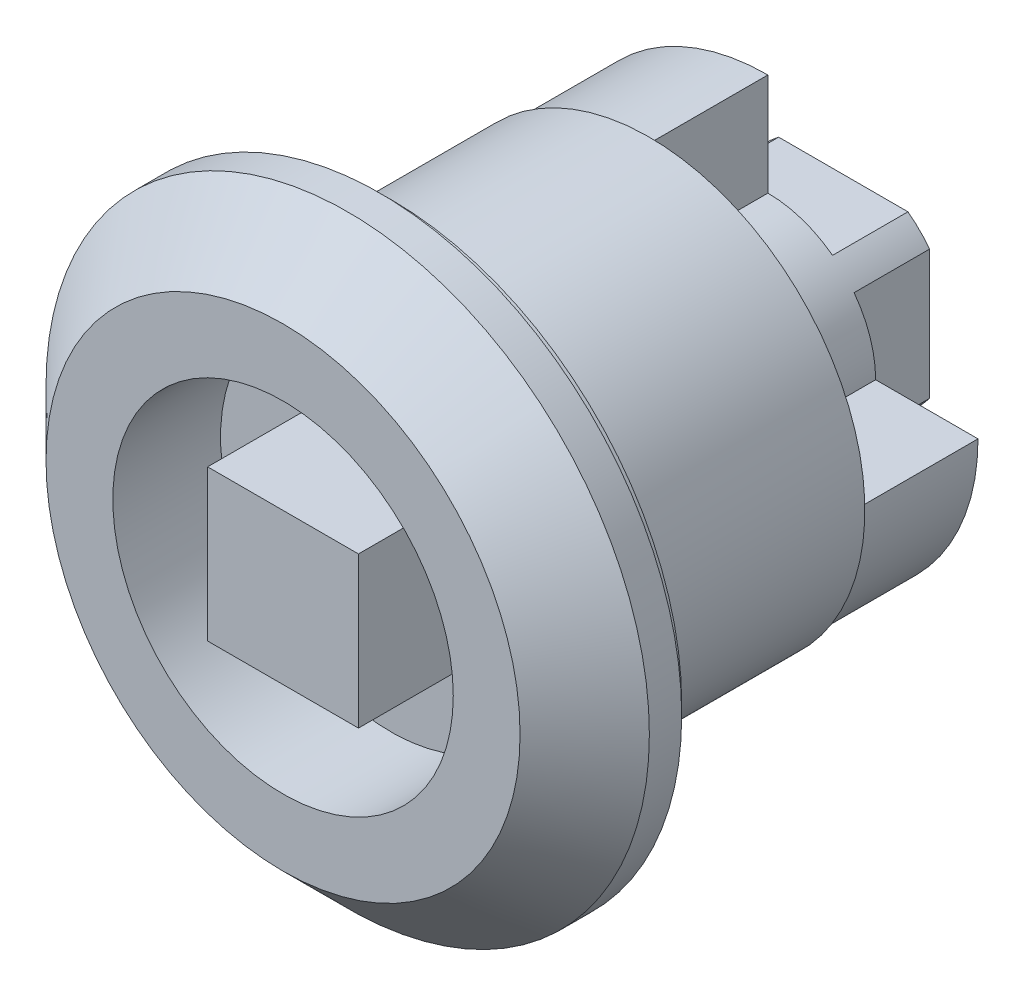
ISO-10303-21;
HEADER;
FILE_DESCRIPTION(('STEP AP214'),'2;1');
FILE_NAME('part.step','',(''),(''),'','','');
FILE_SCHEMA(('AUTOMOTIVE_DESIGN { 1 0 10303 214 1 1 1 1 }'));
ENDSEC;
DATA;
#1=APPLICATION_CONTEXT('core data for automotive mechanical design processes');
#2=APPLICATION_PROTOCOL_DEFINITION('international standard','automotive_design',2000,#1);
#3=PRODUCT_CONTEXT('',#1,'mechanical');
#4=PRODUCT('Part','Part','',(#3));
#5=PRODUCT_RELATED_PRODUCT_CATEGORY('part','',(#4));
#6=PRODUCT_DEFINITION_FORMATION('','',#4);
#7=PRODUCT_DEFINITION_CONTEXT('part definition',#1,'design');
#8=PRODUCT_DEFINITION('design','',#6,#7);
#9=PRODUCT_DEFINITION_SHAPE('','',#8);
#10=(LENGTH_UNIT() NAMED_UNIT(*) SI_UNIT(.MILLI.,.METRE.));
#11=(NAMED_UNIT(*) PLANE_ANGLE_UNIT() SI_UNIT($,.RADIAN.));
#12=(NAMED_UNIT(*) SI_UNIT($,.STERADIAN.) SOLID_ANGLE_UNIT());
#13=UNCERTAINTY_MEASURE_WITH_UNIT(LENGTH_MEASURE(1.E-05),#10,'distance_accuracy_value','');
#14=(GEOMETRIC_REPRESENTATION_CONTEXT(3) GLOBAL_UNCERTAINTY_ASSIGNED_CONTEXT((#13)) GLOBAL_UNIT_ASSIGNED_CONTEXT((#10,
#11,#12)) REPRESENTATION_CONTEXT('',''));
#15=CARTESIAN_POINT('',(0.,0.,0.));
#16=DIRECTION('',(0.,0.,1.));
#17=DIRECTION('',(1.,0.,0.));
#18=AXIS2_PLACEMENT_3D('',#15,#16,#17);
#19=CARTESIAN_POINT('',(0.,0.,-50.));
#20=DIRECTION('',(0.,0.,-1.));
#21=DIRECTION('',(-1.,0.,0.));
#22=AXIS2_PLACEMENT_3D('',#19,#20,#21);
#23=CYLINDRICAL_SURFACE('',#22,5.);
#24=CARTESIAN_POINT('',(0.,0.,-17.5));
#25=DIRECTION('',(0.,0.,-1.));
#26=DIRECTION('',(-1.,0.,0.));
#27=AXIS2_PLACEMENT_3D('',#24,#25,#26);
#28=CIRCLE('',#27,5.);
#29=CARTESIAN_POINT('',(-4.,3.,-17.5));
#30=VERTEX_POINT('',#29);
#31=CARTESIAN_POINT('',(-3.,4.,-17.5));
#32=VERTEX_POINT('',#31);
#33=EDGE_CURVE('E262',#30,#32,#28,.T.);
#34=ORIENTED_EDGE('',*,*,#33,.T.);
#35=DIRECTION('',(0.,0.,-1.));
#36=VECTOR('',#35,1.);
#37=CARTESIAN_POINT('',(-3.,4.,-11.4172374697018));
#38=LINE('',#37,#36);
#39=CARTESIAN_POINT('',(-3.,4.,-21.));
#40=VERTEX_POINT('',#39);
#41=EDGE_CURVE('E204',#32,#40,#38,.T.);
#42=ORIENTED_EDGE('',*,*,#41,.T.);
#43=CARTESIAN_POINT('',(0.,0.,-21.));
#44=DIRECTION('',(0.,0.,-1.));
#45=DIRECTION('',(-1.,0.,0.));
#46=AXIS2_PLACEMENT_3D('',#43,#44,#45);
#47=CIRCLE('',#46,5.);
#48=CARTESIAN_POINT('',(-4.,3.,-21.));
#49=VERTEX_POINT('',#48);
#50=EDGE_CURVE('E264',#49,#40,#47,.T.);
#51=ORIENTED_EDGE('',*,*,#50,.F.);
#52=DIRECTION('',(0.,0.,-1.));
#53=VECTOR('',#52,1.);
#54=CARTESIAN_POINT('',(-4.,3.,-11.4172374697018));
#55=LINE('',#54,#53);
#56=EDGE_CURVE('E228',#30,#49,#55,.T.);
#57=ORIENTED_EDGE('',*,*,#56,.F.);
#58=EDGE_LOOP('',(#34,#42,#51,#57));
#59=FACE_BOUND('',#58,.T.);
#60=ADVANCED_FACE('F14',(#59),#23,.T.);
#61=DIRECTION('',(0.,0.,-1.));
#62=VECTOR('',#61,1.);
#63=CARTESIAN_POINT('',(-3.,-4.,-11.4172374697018));
#64=LINE('',#63,#62);
#65=CARTESIAN_POINT('',(-3.,-4.,-17.5));
#66=VERTEX_POINT('',#65);
#67=CARTESIAN_POINT('',(-3.,-4.,-21.));
#68=VERTEX_POINT('',#67);
#69=EDGE_CURVE('E209',#66,#68,#64,.T.);
#70=ORIENTED_EDGE('',*,*,#69,.F.);
#71=CARTESIAN_POINT('',(-4.,-3.,-17.5));
#72=VERTEX_POINT('',#71);
#73=EDGE_CURVE('E269',#66,#72,#28,.T.);
#74=ORIENTED_EDGE('',*,*,#73,.T.);
#75=DIRECTION('',(0.,0.,-1.));
#76=VECTOR('',#75,1.);
#77=CARTESIAN_POINT('',(-4.,-3.,-11.4172374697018));
#78=LINE('',#77,#76);
#79=CARTESIAN_POINT('',(-4.,-3.,-21.));
#80=VERTEX_POINT('',#79);
#81=EDGE_CURVE('E225',#72,#80,#78,.T.);
#82=ORIENTED_EDGE('',*,*,#81,.T.);
#83=EDGE_CURVE('E263',#68,#80,#47,.T.);
#84=ORIENTED_EDGE('',*,*,#83,.F.);
#85=EDGE_LOOP('',(#70,#74,#82,#84));
#86=FACE_BOUND('',#85,.T.);
#87=ADVANCED_FACE('F316',(#86),#23,.T.);
#88=DIRECTION('',(0.,0.,-1.));
#89=VECTOR('',#88,1.);
#90=CARTESIAN_POINT('',(3.,-4.,-11.4172374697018));
#91=LINE('',#90,#89);
#92=CARTESIAN_POINT('',(3.,-4.,-17.5));
#93=VERTEX_POINT('',#92);
#94=CARTESIAN_POINT('',(3.,-4.,-21.));
#95=VERTEX_POINT('',#94);
#96=EDGE_CURVE('E214',#93,#95,#91,.T.);
#97=ORIENTED_EDGE('',*,*,#96,.T.);
#98=CARTESIAN_POINT('',(4.,-3.,-21.));
#99=VERTEX_POINT('',#98);
#100=EDGE_CURVE('E259',#99,#95,#47,.T.);
#101=ORIENTED_EDGE('',*,*,#100,.F.);
#102=DIRECTION('',(0.,0.,-1.));
#103=VECTOR('',#102,1.);
#104=CARTESIAN_POINT('',(4.,-3.,-11.4172374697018));
#105=LINE('',#104,#103);
#106=CARTESIAN_POINT('',(4.,-3.,-17.5));
#107=VERTEX_POINT('',#106);
#108=EDGE_CURVE('E230',#107,#99,#105,.T.);
#109=ORIENTED_EDGE('',*,*,#108,.F.);
#110=EDGE_CURVE('E265',#107,#93,#28,.T.);
#111=ORIENTED_EDGE('',*,*,#110,.T.);
#112=EDGE_LOOP('',(#97,#101,#109,#111));
#113=FACE_BOUND('',#112,.T.);
#114=ADVANCED_FACE('F327',(#113),#23,.T.);
#115=CARTESIAN_POINT('',(0.,5.,-21.));
#116=DIRECTION('',(0.,0.,1.));
#117=DIRECTION('',(1.,0.,0.));
#118=AXIS2_PLACEMENT_3D('',#115,#116,#117);
#119=PLANE('',#118);
#120=CARTESIAN_POINT('',(0.,0.,-21.));
#121=DIRECTION('',(0.,0.,-1.));
#122=DIRECTION('',(-1.,0.,0.));
#123=AXIS2_PLACEMENT_3D('',#120,#121,#122);
#124=CIRCLE('',#123,3.);
#125=CARTESIAN_POINT('',(-3.,0.,-21.));
#126=VERTEX_POINT('',#125);
#127=EDGE_CURVE('E172',#126,#126,#124,.T.);
#128=ORIENTED_EDGE('',*,*,#127,.F.);
#129=EDGE_LOOP('',(#128));
#130=FACE_BOUND('',#129,.T.);
#131=ORIENTED_EDGE('',*,*,#50,.T.);
#132=DIRECTION('',(-1.,0.,0.));
#133=VECTOR('',#132,1.);
#134=CARTESIAN_POINT('',(3.,4.,-21.));
#135=LINE('',#134,#133);
#136=CARTESIAN_POINT('',(3.,4.,-21.));
#137=VERTEX_POINT('',#136);
#138=EDGE_CURVE('E194',#137,#40,#135,.T.);
#139=ORIENTED_EDGE('',*,*,#138,.F.);
#140=CARTESIAN_POINT('',(4.,3.,-21.));
#141=VERTEX_POINT('',#140);
#142=EDGE_CURVE('E258',#137,#141,#47,.T.);
#143=ORIENTED_EDGE('',*,*,#142,.T.);
#144=DIRECTION('',(0.,-1.,0.));
#145=VECTOR('',#144,1.);
#146=CARTESIAN_POINT('',(4.,3.,-21.));
#147=LINE('',#146,#145);
#148=EDGE_CURVE('E231',#141,#99,#147,.T.);
#149=ORIENTED_EDGE('',*,*,#148,.T.);
#150=ORIENTED_EDGE('',*,*,#100,.T.);
#151=DIRECTION('',(-1.,0.,0.));
#152=VECTOR('',#151,1.);
#153=CARTESIAN_POINT('',(3.,-4.,-21.));
#154=LINE('',#153,#152);
#155=EDGE_CURVE('E210',#95,#68,#154,.T.);
#156=ORIENTED_EDGE('',*,*,#155,.T.);
#157=ORIENTED_EDGE('',*,*,#83,.T.);
#158=DIRECTION('',(0.,-1.,0.));
#159=VECTOR('',#158,1.);
#160=CARTESIAN_POINT('',(-4.,3.,-21.));
#161=LINE('',#160,#159);
#162=EDGE_CURVE('E216',#49,#80,#161,.T.);
#163=ORIENTED_EDGE('',*,*,#162,.F.);
#164=EDGE_LOOP('',(#131,#139,#143,#149,#150,#156,#157,#163));
#165=FACE_BOUND('',#164,.T.);
#166=ADVANCED_FACE('F304',(#130,#165),#119,.F.);
#167=ORIENTED_EDGE('',*,*,#142,.F.);
#168=DIRECTION('',(0.,0.,-1.));
#169=VECTOR('',#168,1.);
#170=CARTESIAN_POINT('',(3.,4.,-11.4172374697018));
#171=LINE('',#170,#169);
#172=CARTESIAN_POINT('',(3.,4.,-17.5));
#173=VERTEX_POINT('',#172);
#174=EDGE_CURVE('E207',#173,#137,#171,.T.);
#175=ORIENTED_EDGE('',*,*,#174,.F.);
#176=CARTESIAN_POINT('',(0.,0.,-17.5));
#177=DIRECTION('',(0.,0.,-1.));
#178=DIRECTION('',(-1.,0.,0.));
#179=AXIS2_PLACEMENT_3D('',#176,#177,#178);
#180=CIRCLE('',#179,5.);
#181=CARTESIAN_POINT('',(0.,5.,-17.5));
#182=VERTEX_POINT('',#181);
#183=EDGE_CURVE('E182',#182,#173,#180,.T.);
#184=ORIENTED_EDGE('',*,*,#183,.F.);
#185=DIRECTION('',(0.,0.,-1.));
#186=VECTOR('',#185,1.);
#187=CARTESIAN_POINT('',(0.,5.,1.78858223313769));
#188=LINE('',#187,#186);
#189=CARTESIAN_POINT('',(0.,5.,-12.));
#190=VERTEX_POINT('',#189);
#191=EDGE_CURVE('E197',#190,#182,#188,.T.);
#192=ORIENTED_EDGE('',*,*,#191,.F.);
#193=CARTESIAN_POINT('',(0.,0.,-12.));
#194=DIRECTION('',(0.,0.,1.));
#195=DIRECTION('',(1.,0.,0.));
#196=AXIS2_PLACEMENT_3D('',#193,#194,#195);
#197=CIRCLE('',#196,5.);
#198=CARTESIAN_POINT('',(5.,0.,-12.));
#199=VERTEX_POINT('',#198);
#200=EDGE_CURVE('E180',#190,#199,#197,.F.);
#201=ORIENTED_EDGE('',*,*,#200,.T.);
#202=DIRECTION('',(0.,0.,-1.));
#203=VECTOR('',#202,1.);
#204=CARTESIAN_POINT('',(5.,0.,1.78858223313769));
#205=LINE('',#204,#203);
#206=CARTESIAN_POINT('',(5.,0.,-17.5));
#207=VERTEX_POINT('',#206);
#208=EDGE_CURVE('E184',#199,#207,#205,.T.);
#209=ORIENTED_EDGE('',*,*,#208,.T.);
#210=CARTESIAN_POINT('',(4.,3.,-17.5));
#211=VERTEX_POINT('',#210);
#212=EDGE_CURVE('E185',#211,#207,#180,.T.);
#213=ORIENTED_EDGE('',*,*,#212,.F.);
#214=DIRECTION('',(0.,0.,-1.));
#215=VECTOR('',#214,1.);
#216=CARTESIAN_POINT('',(4.,3.,-11.4172374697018));
#217=LINE('',#216,#215);
#218=EDGE_CURVE('E235',#211,#141,#217,.T.);
#219=ORIENTED_EDGE('',*,*,#218,.T.);
#220=EDGE_LOOP('',(#167,#175,#184,#192,#201,#209,#213,#219));
#221=FACE_BOUND('',#220,.T.);
#222=ADVANCED_FACE('F295',(#221),#23,.T.);
#223=CARTESIAN_POINT('',(0.,0.,-50.));
#224=DIRECTION('',(0.,0.,-1.));
#225=DIRECTION('',(-1.,0.,0.));
#226=AXIS2_PLACEMENT_3D('',#223,#224,#225);
#227=CYLINDRICAL_SURFACE('',#226,10.);
#228=CARTESIAN_POINT('',(0.,0.,-12.));
#229=DIRECTION('',(0.,0.,-1.));
#230=DIRECTION('',(-1.,0.,0.));
#231=AXIS2_PLACEMENT_3D('',#228,#229,#230);
#232=CIRCLE('',#231,10.);
#233=CARTESIAN_POINT('',(-10.,0.,-12.));
#234=VERTEX_POINT('',#233);
#235=EDGE_CURVE('E9',#234,#234,#232,.T.);
#236=ORIENTED_EDGE('',*,*,#235,.F.);
#237=EDGE_LOOP('',(#236));
#238=FACE_BOUND('',#237,.T.);
#239=CARTESIAN_POINT('',(0.,0.,0.));
#240=DIRECTION('',(0.,0.,-1.));
#241=DIRECTION('',(-1.,0.,0.));
#242=AXIS2_PLACEMENT_3D('',#239,#240,#241);
#243=CIRCLE('',#242,10.);
#244=CARTESIAN_POINT('',(-10.,0.,0.));
#245=VERTEX_POINT('',#244);
#246=EDGE_CURVE('E237',#245,#245,#243,.T.);
#247=ORIENTED_EDGE('',*,*,#246,.T.);
#248=EDGE_LOOP('',(#247));
#249=FACE_BOUND('',#248,.T.);
#250=ADVANCED_FACE('F16',(#238,#249),#227,.T.);
#251=CARTESIAN_POINT('',(0.,10.,-12.));
#252=DIRECTION('',(0.,0.,1.));
#253=DIRECTION('',(1.,0.,0.));
#254=AXIS2_PLACEMENT_3D('',#251,#252,#253);
#255=PLANE('',#254);
#256=CARTESIAN_POINT('',(0.,0.,-12.));
#257=DIRECTION('',(0.,0.,-1.));
#258=DIRECTION('',(-1.,0.,0.));
#259=AXIS2_PLACEMENT_3D('',#256,#257,#258);
#260=CIRCLE('',#259,9.75);
#261=CARTESIAN_POINT('',(9.75,0.,-12.));
#262=VERTEX_POINT('',#261);
#263=CARTESIAN_POINT('',(0.,9.75,-12.));
#264=VERTEX_POINT('',#263);
#265=EDGE_CURVE('E22',#262,#264,#260,.T.);
#266=ORIENTED_EDGE('',*,*,#265,.F.);
#267=DIRECTION('',(1.,0.,0.));
#268=VECTOR('',#267,1.);
#269=CARTESIAN_POINT('',(5.,0.,-12.));
#270=LINE('',#269,#268);
#271=EDGE_CURVE('E189',#199,#262,#270,.T.);
#272=ORIENTED_EDGE('',*,*,#271,.F.);
#273=ORIENTED_EDGE('',*,*,#200,.F.);
#274=DIRECTION('',(0.,1.,0.));
#275=VECTOR('',#274,1.);
#276=CARTESIAN_POINT('',(0.,5.,-12.));
#277=LINE('',#276,#275);
#278=EDGE_CURVE('E190',#190,#264,#277,.T.);
#279=ORIENTED_EDGE('',*,*,#278,.T.);
#280=EDGE_LOOP('',(#266,#272,#273,#279));
#281=FACE_BOUND('',#280,.T.);
#282=ORIENTED_EDGE('',*,*,#235,.T.);
#283=EDGE_LOOP('',(#282));
#284=FACE_BOUND('',#283,.T.);
#285=ADVANCED_FACE('F279',(#281,#284),#255,.F.);
#286=CARTESIAN_POINT('',(0.,0.,-50.));
#287=DIRECTION('',(0.,0.,-1.));
#288=DIRECTION('',(-1.,0.,0.));
#289=AXIS2_PLACEMENT_3D('',#286,#287,#288);
#290=CYLINDRICAL_SURFACE('',#289,9.75);
#291=ORIENTED_EDGE('',*,*,#265,.T.);
#292=DIRECTION('',(0.,0.,-1.));
#293=VECTOR('',#292,1.);
#294=CARTESIAN_POINT('',(0.,9.75,1.78858223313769));
#295=LINE('',#294,#293);
#296=CARTESIAN_POINT('',(0.,9.75,-17.5));
#297=VERTEX_POINT('',#296);
#298=EDGE_CURVE('E192',#264,#297,#295,.T.);
#299=ORIENTED_EDGE('',*,*,#298,.T.);
#300=CARTESIAN_POINT('',(0.,0.,-17.5));
#301=DIRECTION('',(0.,0.,-1.));
#302=DIRECTION('',(-1.,0.,0.));
#303=AXIS2_PLACEMENT_3D('',#300,#301,#302);
#304=CIRCLE('',#303,9.75);
#305=CARTESIAN_POINT('',(9.75,0.,-17.5));
#306=VERTEX_POINT('',#305);
#307=EDGE_CURVE('E268',#306,#297,#304,.T.);
#308=ORIENTED_EDGE('',*,*,#307,.F.);
#309=DIRECTION('',(0.,0.,-1.));
#310=VECTOR('',#309,1.);
#311=CARTESIAN_POINT('',(9.75,0.,1.78858223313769));
#312=LINE('',#311,#310);
#313=EDGE_CURVE('E37',#262,#306,#312,.T.);
#314=ORIENTED_EDGE('',*,*,#313,.F.);
#315=EDGE_LOOP('',(#291,#299,#308,#314));
#316=FACE_BOUND('',#315,.T.);
#317=ADVANCED_FACE('F274',(#316),#290,.T.);
#318=CARTESIAN_POINT('',(0.,9.75,-17.5));
#319=DIRECTION('',(0.,0.,1.));
#320=DIRECTION('',(1.,0.,0.));
#321=AXIS2_PLACEMENT_3D('',#318,#319,#320);
#322=PLANE('',#321);
#323=ORIENTED_EDGE('',*,*,#307,.T.);
#324=DIRECTION('',(0.,1.,0.));
#325=VECTOR('',#324,1.);
#326=CARTESIAN_POINT('',(0.,5.,-17.5));
#327=LINE('',#326,#325);
#328=EDGE_CURVE('E178',#182,#297,#327,.T.);
#329=ORIENTED_EDGE('',*,*,#328,.F.);
#330=ORIENTED_EDGE('',*,*,#183,.T.);
#331=DIRECTION('',(-1.,0.,0.));
#332=VECTOR('',#331,1.);
#333=CARTESIAN_POINT('',(3.,4.,-17.5));
#334=LINE('',#333,#332);
#335=EDGE_CURVE('E202',#173,#32,#334,.T.);
#336=ORIENTED_EDGE('',*,*,#335,.T.);
#337=ORIENTED_EDGE('',*,*,#33,.F.);
#338=DIRECTION('',(0.,-1.,0.));
#339=VECTOR('',#338,1.);
#340=CARTESIAN_POINT('',(-4.,3.,-17.5));
#341=LINE('',#340,#339);
#342=EDGE_CURVE('E222',#30,#72,#341,.T.);
#343=ORIENTED_EDGE('',*,*,#342,.T.);
#344=ORIENTED_EDGE('',*,*,#73,.F.);
#345=DIRECTION('',(-1.,0.,0.));
#346=VECTOR('',#345,1.);
#347=CARTESIAN_POINT('',(3.,-4.,-17.5));
#348=LINE('',#347,#346);
#349=EDGE_CURVE('E213',#93,#66,#348,.T.);
#350=ORIENTED_EDGE('',*,*,#349,.F.);
#351=ORIENTED_EDGE('',*,*,#110,.F.);
#352=DIRECTION('',(0.,-1.,0.));
#353=VECTOR('',#352,1.);
#354=CARTESIAN_POINT('',(4.,3.,-17.5));
#355=LINE('',#354,#353);
#356=EDGE_CURVE('E234',#211,#107,#355,.T.);
#357=ORIENTED_EDGE('',*,*,#356,.F.);
#358=ORIENTED_EDGE('',*,*,#212,.T.);
#359=DIRECTION('',(1.,0.,0.));
#360=VECTOR('',#359,1.);
#361=CARTESIAN_POINT('',(5.,0.,-17.5));
#362=LINE('',#361,#360);
#363=EDGE_CURVE('E181',#207,#306,#362,.T.);
#364=ORIENTED_EDGE('',*,*,#363,.T.);
#365=EDGE_LOOP('',(#323,#329,#330,#336,#337,#343,#344,#350,#351,#357,#358,#364));
#366=FACE_BOUND('',#365,.T.);
#367=ADVANCED_FACE('F288',(#366),#322,.F.);
#368=CARTESIAN_POINT('',(0.,11.,5.));
#369=DIRECTION('',(0.,0.,1.));
#370=DIRECTION('',(1.,0.,0.));
#371=AXIS2_PLACEMENT_3D('',#368,#369,#370);
#372=PLANE('',#371);
#373=CARTESIAN_POINT('',(0.,0.,5.));
#374=DIRECTION('',(0.,0.,1.));
#375=DIRECTION('',(1.,0.,0.));
#376=AXIS2_PLACEMENT_3D('',#373,#374,#375);
#377=CIRCLE('',#376,7.9);
#378=CARTESIAN_POINT('',(7.9,0.,5.));
#379=VERTEX_POINT('',#378);
#380=EDGE_CURVE('E166',#379,#379,#377,.T.);
#381=ORIENTED_EDGE('',*,*,#380,.F.);
#382=EDGE_LOOP('',(#381));
#383=FACE_BOUND('',#382,.T.);
#384=CARTESIAN_POINT('',(0.,0.,5.));
#385=DIRECTION('',(0.,0.,-1.));
#386=DIRECTION('',(-1.,0.,0.));
#387=AXIS2_PLACEMENT_3D('',#384,#385,#386);
#388=CIRCLE('',#387,11.);
#389=CARTESIAN_POINT('',(-11.,0.,5.));
#390=VERTEX_POINT('',#389);
#391=EDGE_CURVE('E255',#390,#390,#388,.T.);
#392=ORIENTED_EDGE('',*,*,#391,.F.);
#393=EDGE_LOOP('',(#392));
#394=FACE_BOUND('',#393,.T.);
#395=ADVANCED_FACE('F383',(#383,#394),#372,.T.);
#396=CARTESIAN_POINT('',(0.,0.,5.));
#397=DIRECTION('',(0.,0.,-1.));
#398=DIRECTION('',(-1.,0.,0.));
#399=AXIS2_PLACEMENT_3D('',#396,#397,#398);
#400=CONICAL_SURFACE('',#399,11.,0.785398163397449);
#401=CARTESIAN_POINT('',(0.,0.,2.));
#402=DIRECTION('',(0.,0.,-1.));
#403=DIRECTION('',(-1.,0.,0.));
#404=AXIS2_PLACEMENT_3D('',#401,#402,#403);
#405=CIRCLE('',#404,14.);
#406=CARTESIAN_POINT('',(-14.,0.,2.));
#407=VERTEX_POINT('',#406);
#408=EDGE_CURVE('E252',#407,#407,#405,.T.);
#409=ORIENTED_EDGE('',*,*,#408,.F.);
#410=EDGE_LOOP('',(#409));
#411=FACE_BOUND('',#410,.T.);
#412=ORIENTED_EDGE('',*,*,#391,.T.);
#413=EDGE_LOOP('',(#412));
#414=FACE_BOUND('',#413,.T.);
#415=ADVANCED_FACE('F379',(#411,#414),#400,.T.);
#416=CARTESIAN_POINT('',(0.,0.,-50.));
#417=DIRECTION('',(0.,0.,-1.));
#418=DIRECTION('',(-1.,0.,0.));
#419=AXIS2_PLACEMENT_3D('',#416,#417,#418);
#420=CYLINDRICAL_SURFACE('',#419,14.);
#421=CARTESIAN_POINT('',(0.,0.,0.500000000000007));
#422=DIRECTION('',(0.,0.,-1.));
#423=DIRECTION('',(-1.,0.,0.));
#424=AXIS2_PLACEMENT_3D('',#421,#422,#423);
#425=CIRCLE('',#424,14.);
#426=CARTESIAN_POINT('',(-14.,0.,0.500000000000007));
#427=VERTEX_POINT('',#426);
#428=EDGE_CURVE('E249',#427,#427,#425,.T.);
#429=ORIENTED_EDGE('',*,*,#428,.F.);
#430=EDGE_LOOP('',(#429));
#431=FACE_BOUND('',#430,.T.);
#432=ORIENTED_EDGE('',*,*,#408,.T.);
#433=EDGE_LOOP('',(#432));
#434=FACE_BOUND('',#433,.T.);
#435=ADVANCED_FACE('F375',(#431,#434),#420,.T.);
#436=CARTESIAN_POINT('',(0.,14.,0.50000000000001));
#437=DIRECTION('',(0.,0.,1.));
#438=DIRECTION('',(1.,0.,0.));
#439=AXIS2_PLACEMENT_3D('',#436,#437,#438);
#440=PLANE('',#439);
#441=CARTESIAN_POINT('',(0.,0.,0.500000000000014));
#442=DIRECTION('',(0.,0.,-1.));
#443=DIRECTION('',(-1.,0.,0.));
#444=AXIS2_PLACEMENT_3D('',#441,#442,#443);
#445=CIRCLE('',#444,13.5);
#446=CARTESIAN_POINT('',(-13.5,0.,0.500000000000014));
#447=VERTEX_POINT('',#446);
#448=EDGE_CURVE('E246',#447,#447,#445,.T.);
#449=ORIENTED_EDGE('',*,*,#448,.F.);
#450=EDGE_LOOP('',(#449));
#451=FACE_BOUND('',#450,.T.);
#452=ORIENTED_EDGE('',*,*,#428,.T.);
#453=EDGE_LOOP('',(#452));
#454=FACE_BOUND('',#453,.T.);
#455=ADVANCED_FACE('F371',(#451,#454),#440,.F.);
#456=CARTESIAN_POINT('',(0.,0.,-50.));
#457=DIRECTION('',(0.,0.,-1.));
#458=DIRECTION('',(-1.,0.,0.));
#459=AXIS2_PLACEMENT_3D('',#456,#457,#458);
#460=CYLINDRICAL_SURFACE('',#459,13.5);
#461=ORIENTED_EDGE('',*,*,#448,.T.);
#462=EDGE_LOOP('',(#461));
#463=FACE_BOUND('',#462,.T.);
#464=CARTESIAN_POINT('',(0.,0.,0.));
#465=DIRECTION('',(0.,0.,-1.));
#466=DIRECTION('',(-1.,0.,0.));
#467=AXIS2_PLACEMENT_3D('',#464,#465,#466);
#468=CIRCLE('',#467,13.5);
#469=CARTESIAN_POINT('',(-13.5,0.,0.));
#470=VERTEX_POINT('',#469);
#471=EDGE_CURVE('E243',#470,#470,#468,.T.);
#472=ORIENTED_EDGE('',*,*,#471,.F.);
#473=EDGE_LOOP('',(#472));
#474=FACE_BOUND('',#473,.T.);
#475=ADVANCED_FACE('F367',(#463,#474),#460,.T.);
#476=CARTESIAN_POINT('',(0.,13.5,0.));
#477=DIRECTION('',(0.,0.,1.));
#478=DIRECTION('',(1.,0.,0.));
#479=AXIS2_PLACEMENT_3D('',#476,#477,#478);
#480=PLANE('',#479);
#481=ORIENTED_EDGE('',*,*,#246,.F.);
#482=EDGE_LOOP('',(#481));
#483=FACE_BOUND('',#482,.T.);
#484=ORIENTED_EDGE('',*,*,#471,.T.);
#485=EDGE_LOOP('',(#484));
#486=FACE_BOUND('',#485,.T.);
#487=ADVANCED_FACE('F364',(#483,#486),#480,.F.);
#488=CARTESIAN_POINT('',(4.,3.,-11.4172374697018));
#489=DIRECTION('',(1.,0.,0.));
#490=DIRECTION('',(0.,0.,-1.));
#491=AXIS2_PLACEMENT_3D('',#488,#489,#490);
#492=PLANE('',#491);
#493=ORIENTED_EDGE('',*,*,#356,.T.);
#494=ORIENTED_EDGE('',*,*,#108,.T.);
#495=ORIENTED_EDGE('',*,*,#148,.F.);
#496=ORIENTED_EDGE('',*,*,#218,.F.);
#497=EDGE_LOOP('',(#493,#494,#495,#496));
#498=FACE_BOUND('',#497,.T.);
#499=ADVANCED_FACE('F349',(#498),#492,.T.);
#500=CARTESIAN_POINT('',(-4.,3.,-11.4172374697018));
#501=DIRECTION('',(1.,0.,0.));
#502=DIRECTION('',(0.,0.,-1.));
#503=AXIS2_PLACEMENT_3D('',#500,#501,#502);
#504=PLANE('',#503);
#505=ORIENTED_EDGE('',*,*,#56,.T.);
#506=ORIENTED_EDGE('',*,*,#162,.T.);
#507=ORIENTED_EDGE('',*,*,#81,.F.);
#508=ORIENTED_EDGE('',*,*,#342,.F.);
#509=EDGE_LOOP('',(#505,#506,#507,#508));
#510=FACE_BOUND('',#509,.T.);
#511=ADVANCED_FACE('F315',(#510),#504,.F.);
#512=CARTESIAN_POINT('',(3.,-4.,-11.4172374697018));
#513=DIRECTION('',(0.,-1.,0.));
#514=DIRECTION('',(1.,0.,0.));
#515=AXIS2_PLACEMENT_3D('',#512,#513,#514);
#516=PLANE('',#515);
#517=ORIENTED_EDGE('',*,*,#349,.T.);
#518=ORIENTED_EDGE('',*,*,#69,.T.);
#519=ORIENTED_EDGE('',*,*,#155,.F.);
#520=ORIENTED_EDGE('',*,*,#96,.F.);
#521=EDGE_LOOP('',(#517,#518,#519,#520));
#522=FACE_BOUND('',#521,.T.);
#523=ADVANCED_FACE('F350',(#522),#516,.T.);
#524=CARTESIAN_POINT('',(3.,4.,-11.4172374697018));
#525=DIRECTION('',(0.,-1.,0.));
#526=DIRECTION('',(1.,0.,0.));
#527=AXIS2_PLACEMENT_3D('',#524,#525,#526);
#528=PLANE('',#527);
#529=ORIENTED_EDGE('',*,*,#174,.T.);
#530=ORIENTED_EDGE('',*,*,#138,.T.);
#531=ORIENTED_EDGE('',*,*,#41,.F.);
#532=ORIENTED_EDGE('',*,*,#335,.F.);
#533=EDGE_LOOP('',(#529,#530,#531,#532));
#534=FACE_BOUND('',#533,.T.);
#535=ADVANCED_FACE('F300',(#534),#528,.F.);
#536=CARTESIAN_POINT('',(0.,5.,1.78858223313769));
#537=DIRECTION('',(-1.,0.,0.));
#538=DIRECTION('',(0.,0.,1.));
#539=AXIS2_PLACEMENT_3D('',#536,#537,#538);
#540=PLANE('',#539);
#541=ORIENTED_EDGE('',*,*,#191,.T.);
#542=ORIENTED_EDGE('',*,*,#328,.T.);
#543=ORIENTED_EDGE('',*,*,#298,.F.);
#544=ORIENTED_EDGE('',*,*,#278,.F.);
#545=EDGE_LOOP('',(#541,#542,#543,#544));
#546=FACE_BOUND('',#545,.T.);
#547=ADVANCED_FACE('F284',(#546),#540,.F.);
#548=CARTESIAN_POINT('',(5.,0.,1.78858223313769));
#549=DIRECTION('',(0.,1.,0.));
#550=DIRECTION('',(-1.,0.,0.));
#551=AXIS2_PLACEMENT_3D('',#548,#549,#550);
#552=PLANE('',#551);
#553=ORIENTED_EDGE('',*,*,#271,.T.);
#554=ORIENTED_EDGE('',*,*,#313,.T.);
#555=ORIENTED_EDGE('',*,*,#363,.F.);
#556=ORIENTED_EDGE('',*,*,#208,.F.);
#557=EDGE_LOOP('',(#553,#554,#555,#556));
#558=FACE_BOUND('',#557,.T.);
#559=ADVANCED_FACE('F292',(#558),#552,.T.);
#560=CARTESIAN_POINT('',(0.,0.,-11.));
#561=DIRECTION('',(0.,0.,-1.));
#562=DIRECTION('',(-1.,0.,0.));
#563=AXIS2_PLACEMENT_3D('',#560,#561,#562);
#564=CYLINDRICAL_SURFACE('',#563,3.);
#565=CARTESIAN_POINT('',(0.,0.,-11.));
#566=DIRECTION('',(0.,0.,-1.));
#567=DIRECTION('',(-1.,0.,0.));
#568=AXIS2_PLACEMENT_3D('',#565,#566,#567);
#569=CIRCLE('',#568,3.);
#570=CARTESIAN_POINT('',(-3.,0.,-11.));
#571=VERTEX_POINT('',#570);
#572=EDGE_CURVE('E175',#571,#571,#569,.T.);
#573=ORIENTED_EDGE('',*,*,#572,.F.);
#574=EDGE_LOOP('',(#573));
#575=FACE_BOUND('',#574,.T.);
#576=ORIENTED_EDGE('',*,*,#127,.T.);
#577=EDGE_LOOP('',(#576));
#578=FACE_BOUND('',#577,.T.);
#579=ADVANCED_FACE('F417',(#575,#578),#564,.F.);
#580=CARTESIAN_POINT('',(0.,0.,-11.));
#581=DIRECTION('',(0.,0.,-1.));
#582=DIRECTION('',(-1.,0.,0.));
#583=AXIS2_PLACEMENT_3D('',#580,#581,#582);
#584=PLANE('',#583);
#585=ORIENTED_EDGE('',*,*,#572,.T.);
#586=EDGE_LOOP('',(#585));
#587=FACE_BOUND('',#586,.T.);
#588=ADVANCED_FACE('F420',(#587),#584,.T.);
#589=CARTESIAN_POINT('',(0.,0.,0.));
#590=DIRECTION('',(0.,0.,1.));
#591=DIRECTION('',(1.,0.,0.));
#592=AXIS2_PLACEMENT_3D('',#589,#590,#591);
#593=CYLINDRICAL_SURFACE('',#592,7.9);
#594=CARTESIAN_POINT('',(0.,0.,0.));
#595=DIRECTION('',(0.,0.,1.));
#596=DIRECTION('',(1.,0.,0.));
#597=AXIS2_PLACEMENT_3D('',#594,#595,#596);
#598=CIRCLE('',#597,7.9);
#599=CARTESIAN_POINT('',(7.9,0.,0.));
#600=VERTEX_POINT('',#599);
#601=EDGE_CURVE('E169',#600,#600,#598,.T.);
#602=ORIENTED_EDGE('',*,*,#601,.F.);
#603=EDGE_LOOP('',(#602));
#604=FACE_BOUND('',#603,.T.);
#605=ORIENTED_EDGE('',*,*,#380,.T.);
#606=EDGE_LOOP('',(#605));
#607=FACE_BOUND('',#606,.T.);
#608=ADVANCED_FACE('F415',(#604,#607),#593,.F.);
#609=CARTESIAN_POINT('',(0.,0.,0.));
#610=DIRECTION('',(0.,0.,1.));
#611=DIRECTION('',(1.,0.,0.));
#612=AXIS2_PLACEMENT_3D('',#609,#610,#611);
#613=PLANE('',#612);
#614=DIRECTION('',(1.,0.,0.));
#615=VECTOR('',#614,1.);
#616=CARTESIAN_POINT('',(-3.5,3.5,0.));
#617=LINE('',#616,#615);
#618=CARTESIAN_POINT('',(-3.5,3.5,0.));
#619=VERTEX_POINT('',#618);
#620=CARTESIAN_POINT('',(3.5,3.5,0.));
#621=VERTEX_POINT('',#620);
#622=EDGE_CURVE('E160',#619,#621,#617,.T.);
#623=ORIENTED_EDGE('',*,*,#622,.T.);
#624=DIRECTION('',(0.,1.,0.));
#625=VECTOR('',#624,1.);
#626=CARTESIAN_POINT('',(3.5,-3.5,0.));
#627=LINE('',#626,#625);
#628=CARTESIAN_POINT('',(3.5,-3.5,0.));
#629=VERTEX_POINT('',#628);
#630=EDGE_CURVE('E130',#629,#621,#627,.T.);
#631=ORIENTED_EDGE('',*,*,#630,.F.);
#632=DIRECTION('',(-1.,0.,0.));
#633=VECTOR('',#632,1.);
#634=CARTESIAN_POINT('',(3.5,-3.5,0.));
#635=LINE('',#634,#633);
#636=CARTESIAN_POINT('',(-3.5,-3.5,0.));
#637=VERTEX_POINT('',#636);
#638=EDGE_CURVE('E156',#629,#637,#635,.T.);
#639=ORIENTED_EDGE('',*,*,#638,.T.);
#640=DIRECTION('',(0.,-1.,0.));
#641=VECTOR('',#640,1.);
#642=CARTESIAN_POINT('',(-3.5,3.5,0.));
#643=LINE('',#642,#641);
#644=EDGE_CURVE('E143',#619,#637,#643,.T.);
#645=ORIENTED_EDGE('',*,*,#644,.F.);
#646=EDGE_LOOP('',(#623,#631,#639,#645));
#647=FACE_BOUND('',#646,.T.);
#648=ORIENTED_EDGE('',*,*,#601,.T.);
#649=EDGE_LOOP('',(#648));
#650=FACE_BOUND('',#649,.T.);
#651=ADVANCED_FACE('F412',(#647,#650),#613,.T.);
#652=CARTESIAN_POINT('',(-3.5,3.5,0.));
#653=DIRECTION('',(-1.,0.,0.));
#654=DIRECTION('',(0.,0.,1.));
#655=AXIS2_PLACEMENT_3D('',#652,#653,#654);
#656=PLANE('',#655);
#657=DIRECTION('',(0.,0.,1.));
#658=VECTOR('',#657,1.);
#659=CARTESIAN_POINT('',(-3.5,3.5,0.));
#660=LINE('',#659,#658);
#661=CARTESIAN_POINT('',(-3.5,3.5,5.));
#662=VERTEX_POINT('',#661);
#663=EDGE_CURVE('E134',#619,#662,#660,.T.);
#664=ORIENTED_EDGE('',*,*,#663,.F.);
#665=ORIENTED_EDGE('',*,*,#644,.T.);
#666=DIRECTION('',(0.,0.,1.));
#667=VECTOR('',#666,1.);
#668=CARTESIAN_POINT('',(-3.5,-3.5,0.));
#669=LINE('',#668,#667);
#670=CARTESIAN_POINT('',(-3.5,-3.5,5.));
#671=VERTEX_POINT('',#670);
#672=EDGE_CURVE('E162',#637,#671,#669,.T.);
#673=ORIENTED_EDGE('',*,*,#672,.T.);
#674=DIRECTION('',(0.,-1.,0.));
#675=VECTOR('',#674,1.);
#676=CARTESIAN_POINT('',(-3.5,3.5,5.));
#677=LINE('',#676,#675);
#678=EDGE_CURVE('E150',#662,#671,#677,.T.);
#679=ORIENTED_EDGE('',*,*,#678,.F.);
#680=EDGE_LOOP('',(#664,#665,#673,#679));
#681=FACE_BOUND('',#680,.T.);
#682=ADVANCED_FACE('F408',(#681),#656,.T.);
#683=CARTESIAN_POINT('',(-3.5,3.5,0.));
#684=DIRECTION('',(0.,-1.,0.));
#685=DIRECTION('',(1.,0.,0.));
#686=AXIS2_PLACEMENT_3D('',#683,#684,#685);
#687=PLANE('',#686);
#688=DIRECTION('',(0.,0.,1.));
#689=VECTOR('',#688,1.);
#690=CARTESIAN_POINT('',(3.5,3.5,0.));
#691=LINE('',#690,#689);
#692=CARTESIAN_POINT('',(3.5,3.5,5.));
#693=VERTEX_POINT('',#692);
#694=EDGE_CURVE('E127',#621,#693,#691,.T.);
#695=ORIENTED_EDGE('',*,*,#694,.F.);
#696=ORIENTED_EDGE('',*,*,#622,.F.);
#697=ORIENTED_EDGE('',*,*,#663,.T.);
#698=DIRECTION('',(1.,0.,0.));
#699=VECTOR('',#698,1.);
#700=CARTESIAN_POINT('',(-3.5,3.5,5.));
#701=LINE('',#700,#699);
#702=EDGE_CURVE('E138',#662,#693,#701,.T.);
#703=ORIENTED_EDGE('',*,*,#702,.T.);
#704=EDGE_LOOP('',(#695,#696,#697,#703));
#705=FACE_BOUND('',#704,.T.);
#706=ADVANCED_FACE('F139',(#705),#687,.F.);
#707=CARTESIAN_POINT('',(3.5,-3.5,0.));
#708=DIRECTION('',(1.,0.,0.));
#709=DIRECTION('',(0.,0.,-1.));
#710=AXIS2_PLACEMENT_3D('',#707,#708,#709);
#711=PLANE('',#710);
#712=DIRECTION('',(0.,0.,1.));
#713=VECTOR('',#712,1.);
#714=CARTESIAN_POINT('',(3.5,-3.5,0.));
#715=LINE('',#714,#713);
#716=CARTESIAN_POINT('',(3.5,-3.5,5.));
#717=VERTEX_POINT('',#716);
#718=EDGE_CURVE('E135',#629,#717,#715,.T.);
#719=ORIENTED_EDGE('',*,*,#718,.F.);
#720=ORIENTED_EDGE('',*,*,#630,.T.);
#721=ORIENTED_EDGE('',*,*,#694,.T.);
#722=DIRECTION('',(0.,1.,0.));
#723=VECTOR('',#722,1.);
#724=CARTESIAN_POINT('',(3.5,-3.5,5.));
#725=LINE('',#724,#723);
#726=EDGE_CURVE('E29',#717,#693,#725,.T.);
#727=ORIENTED_EDGE('',*,*,#726,.F.);
#728=EDGE_LOOP('',(#719,#720,#721,#727));
#729=FACE_BOUND('',#728,.T.);
#730=ADVANCED_FACE('F129',(#729),#711,.T.);
#731=CARTESIAN_POINT('',(3.5,-3.5,0.));
#732=DIRECTION('',(0.,1.,0.));
#733=DIRECTION('',(-1.,0.,0.));
#734=AXIS2_PLACEMENT_3D('',#731,#732,#733);
#735=PLANE('',#734);
#736=ORIENTED_EDGE('',*,*,#638,.F.);
#737=ORIENTED_EDGE('',*,*,#718,.T.);
#738=DIRECTION('',(-1.,0.,0.));
#739=VECTOR('',#738,1.);
#740=CARTESIAN_POINT('',(3.5,-3.5,5.));
#741=LINE('',#740,#739);
#742=EDGE_CURVE('E148',#717,#671,#741,.T.);
#743=ORIENTED_EDGE('',*,*,#742,.T.);
#744=ORIENTED_EDGE('',*,*,#672,.F.);
#745=EDGE_LOOP('',(#736,#737,#743,#744));
#746=FACE_BOUND('',#745,.T.);
#747=ADVANCED_FACE('F394',(#746),#735,.F.);
#748=ORIENTED_EDGE('',*,*,#702,.F.);
#749=ORIENTED_EDGE('',*,*,#678,.T.);
#750=ORIENTED_EDGE('',*,*,#742,.F.);
#751=ORIENTED_EDGE('',*,*,#726,.T.);
#752=EDGE_LOOP('',(#748,#749,#750,#751));
#753=FACE_BOUND('',#752,.T.);
#754=ADVANCED_FACE('F146',(#753),#372,.T.);
#755=CLOSED_SHELL('',(#60,#87,#114,#166,#222,#250,#285,#317,#367,#395,#415,#435,#455,#475,#487,
#499,#511,#523,#535,#547,#559,#579,#588,#608,#651,#682,#706,#730,#747,#754));
#756=MANIFOLD_SOLID_BREP('B1',#755);
#757=ADVANCED_BREP_SHAPE_REPRESENTATION('',(#18,#756),#14);
#758=SHAPE_DEFINITION_REPRESENTATION(#9,#757);
ENDSEC;
END-ISO-10303-21;
